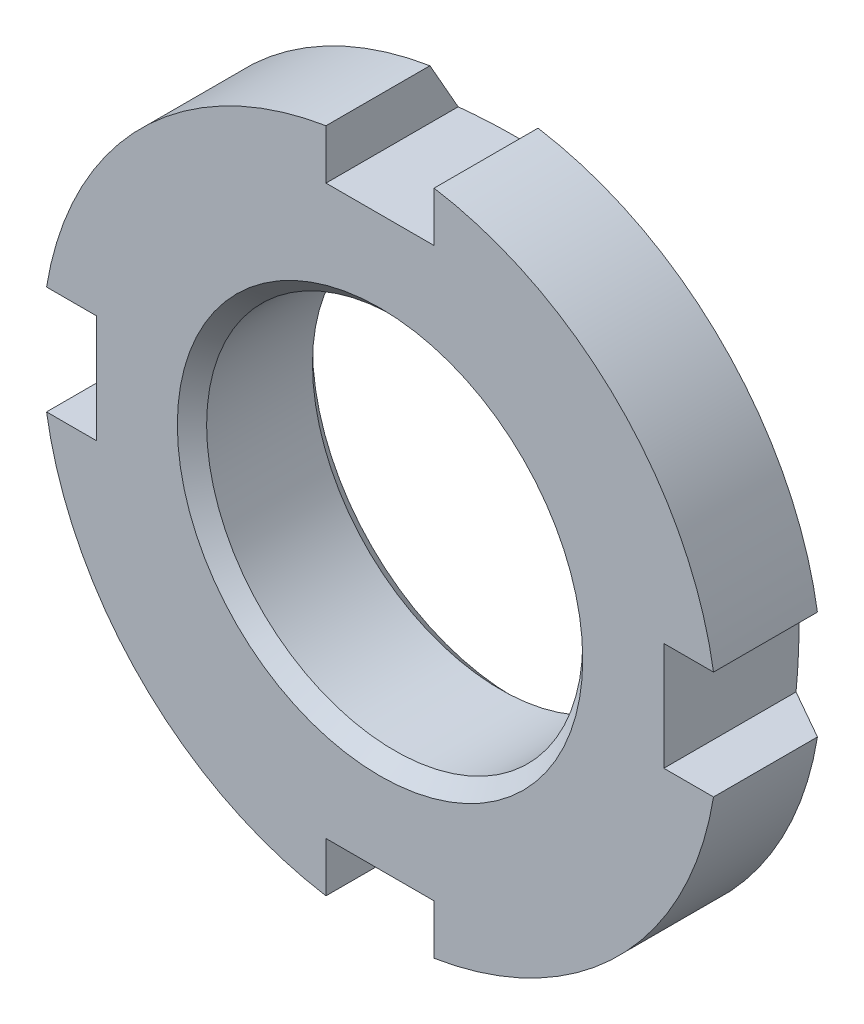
ISO-10303-21;
HEADER;
FILE_DESCRIPTION(('STEP AP214'),'2;1');
FILE_NAME('part.step','',(''),(''),'','','');
FILE_SCHEMA(('AUTOMOTIVE_DESIGN { 1 0 10303 214 1 1 1 1 }'));
ENDSEC;
DATA;
#1=APPLICATION_CONTEXT('core data for automotive mechanical design processes');
#2=APPLICATION_PROTOCOL_DEFINITION('international standard','automotive_design',2000,#1);
#3=PRODUCT_CONTEXT('',#1,'mechanical');
#4=PRODUCT('Part','Part','',(#3));
#5=PRODUCT_RELATED_PRODUCT_CATEGORY('part','',(#4));
#6=PRODUCT_DEFINITION_FORMATION('','',#4);
#7=PRODUCT_DEFINITION_CONTEXT('part definition',#1,'design');
#8=PRODUCT_DEFINITION('design','',#6,#7);
#9=PRODUCT_DEFINITION_SHAPE('','',#8);
#10=(LENGTH_UNIT() NAMED_UNIT(*) SI_UNIT(.MILLI.,.METRE.));
#11=(NAMED_UNIT(*) PLANE_ANGLE_UNIT() SI_UNIT($,.RADIAN.));
#12=(NAMED_UNIT(*) SI_UNIT($,.STERADIAN.) SOLID_ANGLE_UNIT());
#13=UNCERTAINTY_MEASURE_WITH_UNIT(LENGTH_MEASURE(1.E-05),#10,'distance_accuracy_value','');
#14=(GEOMETRIC_REPRESENTATION_CONTEXT(3) GLOBAL_UNCERTAINTY_ASSIGNED_CONTEXT((#13)) GLOBAL_UNIT_ASSIGNED_CONTEXT((#10,
#11,#12)) REPRESENTATION_CONTEXT('',''));
#15=CARTESIAN_POINT('',(0.,0.,0.));
#16=DIRECTION('',(0.,0.,1.));
#17=DIRECTION('',(1.,0.,0.));
#18=AXIS2_PLACEMENT_3D('',#15,#16,#17);
#19=CARTESIAN_POINT('',(0.,0.,-5.));
#20=DIRECTION('',(0.,0.,1.));
#21=DIRECTION('',(1.,0.,0.));
#22=AXIS2_PLACEMENT_3D('',#19,#20,#21);
#23=CYLINDRICAL_SURFACE('',#22,12.5);
#24=DIRECTION('',(0.,0.,1.));
#25=VECTOR('',#24,1.);
#26=CARTESIAN_POINT('',(-2.,12.3389626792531,-5.));
#27=LINE('',#26,#25);
#28=CARTESIAN_POINT('',(-2.,12.3389626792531,-3.8452994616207));
#29=VERTEX_POINT('',#28);
#30=CARTESIAN_POINT('',(-2.,12.3389626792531,0.));
#31=VERTEX_POINT('',#30);
#32=EDGE_CURVE('E240',#29,#31,#27,.T.);
#33=ORIENTED_EDGE('',*,*,#32,.F.);
#34=CARTESIAN_POINT('',(0.,0.,-3.8452994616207));
#35=DIRECTION('',(0.,0.,1.));
#36=DIRECTION('',(1.,0.,0.));
#37=AXIS2_PLACEMENT_3D('',#34,#35,#36);
#38=CIRCLE('',#37,12.5);
#39=CARTESIAN_POINT('',(-12.3389626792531,2.,-3.8452994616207));
#40=VERTEX_POINT('',#39);
#41=EDGE_CURVE('E247',#29,#40,#38,.T.);
#42=ORIENTED_EDGE('',*,*,#41,.T.);
#43=DIRECTION('',(0.,0.,1.));
#44=VECTOR('',#43,1.);
#45=CARTESIAN_POINT('',(-12.3389626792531,2.,-5.));
#46=LINE('',#45,#44);
#47=CARTESIAN_POINT('',(-12.3389626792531,2.,0.));
#48=VERTEX_POINT('',#47);
#49=EDGE_CURVE('E217',#48,#40,#46,.F.);
#50=ORIENTED_EDGE('',*,*,#49,.F.);
#51=CARTESIAN_POINT('',(0.,0.,0.));
#52=DIRECTION('',(0.,0.,1.));
#53=DIRECTION('',(1.,0.,0.));
#54=AXIS2_PLACEMENT_3D('',#51,#52,#53);
#55=CIRCLE('',#54,12.5);
#56=EDGE_CURVE('E186',#31,#48,#55,.T.);
#57=ORIENTED_EDGE('',*,*,#56,.F.);
#58=EDGE_LOOP('',(#33,#42,#50,#57));
#59=FACE_BOUND('',#58,.T.);
#60=ADVANCED_FACE('F33',(#59),#23,.T.);
#61=DIRECTION('',(0.,0.,1.));
#62=VECTOR('',#61,1.);
#63=CARTESIAN_POINT('',(2.,12.3389626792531,-5.));
#64=LINE('',#63,#62);
#65=CARTESIAN_POINT('',(2.,12.3389626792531,0.));
#66=VERTEX_POINT('',#65);
#67=CARTESIAN_POINT('',(2.,12.3389626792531,-3.8452994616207));
#68=VERTEX_POINT('',#67);
#69=EDGE_CURVE('E238',#66,#68,#64,.F.);
#70=ORIENTED_EDGE('',*,*,#69,.F.);
#71=CARTESIAN_POINT('',(12.3389626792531,2.,0.));
#72=VERTEX_POINT('',#71);
#73=EDGE_CURVE('E265',#72,#66,#55,.T.);
#74=ORIENTED_EDGE('',*,*,#73,.F.);
#75=DIRECTION('',(0.,0.,1.));
#76=VECTOR('',#75,1.);
#77=CARTESIAN_POINT('',(12.3389626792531,2.,-5.));
#78=LINE('',#77,#76);
#79=CARTESIAN_POINT('',(12.3389626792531,2.,-3.8452994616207));
#80=VERTEX_POINT('',#79);
#81=EDGE_CURVE('E236',#80,#72,#78,.T.);
#82=ORIENTED_EDGE('',*,*,#81,.F.);
#83=EDGE_CURVE('E243',#80,#68,#38,.T.);
#84=ORIENTED_EDGE('',*,*,#83,.T.);
#85=EDGE_LOOP('',(#70,#74,#82,#84));
#86=FACE_BOUND('',#85,.T.);
#87=ADVANCED_FACE('F440',(#86),#23,.T.);
#88=DIRECTION('',(0.,0.,1.));
#89=VECTOR('',#88,1.);
#90=CARTESIAN_POINT('',(12.3389626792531,-2.,-5.));
#91=LINE('',#90,#89);
#92=CARTESIAN_POINT('',(12.3389626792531,-2.,0.));
#93=VERTEX_POINT('',#92);
#94=CARTESIAN_POINT('',(12.3389626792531,-2.,-3.8452994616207));
#95=VERTEX_POINT('',#94);
#96=EDGE_CURVE('E52',#93,#95,#91,.F.);
#97=ORIENTED_EDGE('',*,*,#96,.F.);
#98=CARTESIAN_POINT('',(2.,-12.3389626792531,0.));
#99=VERTEX_POINT('',#98);
#100=EDGE_CURVE('E264',#99,#93,#55,.T.);
#101=ORIENTED_EDGE('',*,*,#100,.F.);
#102=DIRECTION('',(0.,0.,1.));
#103=VECTOR('',#102,1.);
#104=CARTESIAN_POINT('',(2.,-12.3389626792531,-5.));
#105=LINE('',#104,#103);
#106=CARTESIAN_POINT('',(2.,-12.3389626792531,-3.8452994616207));
#107=VERTEX_POINT('',#106);
#108=EDGE_CURVE('E233',#107,#99,#105,.T.);
#109=ORIENTED_EDGE('',*,*,#108,.F.);
#110=EDGE_CURVE('E242',#107,#95,#38,.T.);
#111=ORIENTED_EDGE('',*,*,#110,.T.);
#112=EDGE_LOOP('',(#97,#101,#109,#111));
#113=FACE_BOUND('',#112,.T.);
#114=ADVANCED_FACE('F412',(#113),#23,.T.);
#115=DIRECTION('',(0.,0.,1.));
#116=VECTOR('',#115,1.);
#117=CARTESIAN_POINT('',(-2.,-12.3389626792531,-5.));
#118=LINE('',#117,#116);
#119=CARTESIAN_POINT('',(-2.,-12.3389626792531,0.));
#120=VERTEX_POINT('',#119);
#121=CARTESIAN_POINT('',(-2.,-12.3389626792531,-3.8452994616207));
#122=VERTEX_POINT('',#121);
#123=EDGE_CURVE('E60',#120,#122,#118,.F.);
#124=ORIENTED_EDGE('',*,*,#123,.F.);
#125=CARTESIAN_POINT('',(-12.3389626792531,-2.,0.));
#126=VERTEX_POINT('',#125);
#127=EDGE_CURVE('E430',#126,#120,#55,.T.);
#128=ORIENTED_EDGE('',*,*,#127,.F.);
#129=DIRECTION('',(0.,0.,1.));
#130=VECTOR('',#129,1.);
#131=CARTESIAN_POINT('',(-12.3389626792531,-2.,-5.));
#132=LINE('',#131,#130);
#133=CARTESIAN_POINT('',(-12.3389626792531,-2.,-3.8452994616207));
#134=VERTEX_POINT('',#133);
#135=EDGE_CURVE('E230',#134,#126,#132,.T.);
#136=ORIENTED_EDGE('',*,*,#135,.F.);
#137=EDGE_CURVE('E414',#134,#122,#38,.T.);
#138=ORIENTED_EDGE('',*,*,#137,.T.);
#139=EDGE_LOOP('',(#124,#128,#136,#138));
#140=FACE_BOUND('',#139,.T.);
#141=ADVANCED_FACE('F431',(#140),#23,.T.);
#142=CARTESIAN_POINT('',(0.,12.5,0.));
#143=DIRECTION('',(0.,0.,-1.));
#144=DIRECTION('',(-1.,0.,0.));
#145=AXIS2_PLACEMENT_3D('',#142,#143,#144);
#146=PLANE('',#145);
#147=CARTESIAN_POINT('',(0.,0.,0.));
#148=DIRECTION('',(0.,0.,1.));
#149=DIRECTION('',(1.,0.,0.));
#150=AXIS2_PLACEMENT_3D('',#147,#148,#149);
#151=CIRCLE('',#150,7.5);
#152=CARTESIAN_POINT('',(7.5,0.,0.));
#153=VERTEX_POINT('',#152);
#154=EDGE_CURVE('E261',#153,#153,#151,.T.);
#155=ORIENTED_EDGE('',*,*,#154,.F.);
#156=EDGE_LOOP('',(#155));
#157=FACE_BOUND('',#156,.T.);
#158=DIRECTION('',(0.,1.,0.));
#159=VECTOR('',#158,1.);
#160=CARTESIAN_POINT('',(-2.,10.5,0.));
#161=LINE('',#160,#159);
#162=CARTESIAN_POINT('',(-2.,10.5,0.));
#163=VERTEX_POINT('',#162);
#164=EDGE_CURVE('E171',#163,#31,#161,.T.);
#165=ORIENTED_EDGE('',*,*,#164,.T.);
#166=ORIENTED_EDGE('',*,*,#56,.T.);
#167=DIRECTION('',(1.,0.,0.));
#168=VECTOR('',#167,1.);
#169=CARTESIAN_POINT('',(-19.126486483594,2.,0.));
#170=LINE('',#169,#168);
#171=CARTESIAN_POINT('',(-10.5,2.,0.));
#172=VERTEX_POINT('',#171);
#173=EDGE_CURVE('E164',#48,#172,#170,.T.);
#174=ORIENTED_EDGE('',*,*,#173,.T.);
#175=DIRECTION('',(0.,-1.,0.));
#176=VECTOR('',#175,1.);
#177=CARTESIAN_POINT('',(-10.5,2.,0.));
#178=LINE('',#177,#176);
#179=CARTESIAN_POINT('',(-10.5,-2.,0.));
#180=VERTEX_POINT('',#179);
#181=EDGE_CURVE('E174',#172,#180,#178,.T.);
#182=ORIENTED_EDGE('',*,*,#181,.T.);
#183=DIRECTION('',(-1.,0.,0.));
#184=VECTOR('',#183,1.);
#185=CARTESIAN_POINT('',(-10.5,-2.,0.));
#186=LINE('',#185,#184);
#187=EDGE_CURVE('E180',#180,#126,#186,.T.);
#188=ORIENTED_EDGE('',*,*,#187,.T.);
#189=ORIENTED_EDGE('',*,*,#127,.T.);
#190=DIRECTION('',(0.,1.,0.));
#191=VECTOR('',#190,1.);
#192=CARTESIAN_POINT('',(-2.,-19.126486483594,0.));
#193=LINE('',#192,#191);
#194=CARTESIAN_POINT('',(-2.,-10.5,0.));
#195=VERTEX_POINT('',#194);
#196=EDGE_CURVE('E190',#120,#195,#193,.T.);
#197=ORIENTED_EDGE('',*,*,#196,.T.);
#198=DIRECTION('',(1.,0.,0.));
#199=VECTOR('',#198,1.);
#200=CARTESIAN_POINT('',(-2.,-10.5,0.));
#201=LINE('',#200,#199);
#202=CARTESIAN_POINT('',(2.,-10.5,0.));
#203=VERTEX_POINT('',#202);
#204=EDGE_CURVE('E193',#195,#203,#201,.T.);
#205=ORIENTED_EDGE('',*,*,#204,.T.);
#206=DIRECTION('',(0.,-1.,0.));
#207=VECTOR('',#206,1.);
#208=CARTESIAN_POINT('',(2.,-10.5,0.));
#209=LINE('',#208,#207);
#210=EDGE_CURVE('E196',#203,#99,#209,.T.);
#211=ORIENTED_EDGE('',*,*,#210,.T.);
#212=ORIENTED_EDGE('',*,*,#100,.T.);
#213=DIRECTION('',(-1.,0.,0.));
#214=VECTOR('',#213,1.);
#215=CARTESIAN_POINT('',(19.126486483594,-2.,0.));
#216=LINE('',#215,#214);
#217=CARTESIAN_POINT('',(10.5,-2.,0.));
#218=VERTEX_POINT('',#217);
#219=EDGE_CURVE('E199',#93,#218,#216,.T.);
#220=ORIENTED_EDGE('',*,*,#219,.T.);
#221=DIRECTION('',(0.,1.,0.));
#222=VECTOR('',#221,1.);
#223=CARTESIAN_POINT('',(10.5,-2.,0.));
#224=LINE('',#223,#222);
#225=CARTESIAN_POINT('',(10.5,2.,0.));
#226=VERTEX_POINT('',#225);
#227=EDGE_CURVE('E202',#218,#226,#224,.T.);
#228=ORIENTED_EDGE('',*,*,#227,.T.);
#229=DIRECTION('',(1.,0.,0.));
#230=VECTOR('',#229,1.);
#231=CARTESIAN_POINT('',(10.5,2.,0.));
#232=LINE('',#231,#230);
#233=EDGE_CURVE('E205',#226,#72,#232,.T.);
#234=ORIENTED_EDGE('',*,*,#233,.T.);
#235=ORIENTED_EDGE('',*,*,#73,.T.);
#236=DIRECTION('',(0.,-1.,0.));
#237=VECTOR('',#236,1.);
#238=CARTESIAN_POINT('',(2.,19.126486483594,0.));
#239=LINE('',#238,#237);
#240=CARTESIAN_POINT('',(2.,10.5,0.));
#241=VERTEX_POINT('',#240);
#242=EDGE_CURVE('E208',#66,#241,#239,.T.);
#243=ORIENTED_EDGE('',*,*,#242,.T.);
#244=DIRECTION('',(-1.,0.,0.));
#245=VECTOR('',#244,1.);
#246=CARTESIAN_POINT('',(2.,10.5,0.));
#247=LINE('',#246,#245);
#248=EDGE_CURVE('E211',#241,#163,#247,.T.);
#249=ORIENTED_EDGE('',*,*,#248,.T.);
#250=EDGE_LOOP('',(#165,#166,#174,#182,#188,#189,#197,#205,#211,#212,#220,#228,#234,#235,#243,#249));
#251=FACE_BOUND('',#250,.T.);
#252=ADVANCED_FACE('F184',(#157,#251),#146,.F.);
#253=CARTESIAN_POINT('',(0.,0.,-5.));
#254=DIRECTION('',(0.,0.,1.));
#255=DIRECTION('',(1.,0.,0.));
#256=AXIS2_PLACEMENT_3D('',#253,#254,#255);
#257=CONICAL_SURFACE('',#256,10.5,1.04719755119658);
#258=CARTESIAN_POINT('',(-2.,6.81491479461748,-6.96164681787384));
#259=CARTESIAN_POINT('',(-2.,7.14533990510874,-6.77854960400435));
#260=CARTESIAN_POINT('',(-2.,7.47535686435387,-6.59471912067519));
#261=CARTESIAN_POINT('',(-2.,8.13476714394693,-6.22594601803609));
#262=CARTESIAN_POINT('',(-2.,8.46416046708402,-6.04100340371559));
#263=CARTESIAN_POINT('',(-2.,9.12251597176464,-5.67036055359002));
#264=CARTESIAN_POINT('',(-2.,9.451478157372,-5.48466032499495));
#265=CARTESIAN_POINT('',(-2.,10.1090812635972,-5.11269102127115));
#266=CARTESIAN_POINT('',(-2.,10.4377221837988,-4.92642194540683));
#267=CARTESIAN_POINT('',(-2.,11.4232794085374,-4.36698580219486));
#268=CARTESIAN_POINT('',(-2.,12.0798365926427,-3.99318619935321));
#269=CARTESIAN_POINT('',(-2.,13.0642370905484,-3.43171725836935));
#270=CARTESIAN_POINT('',(-2.,13.3922996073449,-3.24443179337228));
#271=CARTESIAN_POINT('',(-2.,14.0483033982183,-2.86964910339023));
#272=CARTESIAN_POINT('',(-2.,14.3762446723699,-2.68215187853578));
#273=CARTESIAN_POINT('',(-2.,14.7041379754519,-2.49457073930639));
#274=B_SPLINE_CURVE_WITH_KNOTS('',3,(#258,#259,#260,#261,#262,#263,#264,#265,#266,#267,#268,
#269,#270,#271,#272,#273),.UNSPECIFIED.,.F.,.F.,(4,2,2,2,2,2,2,4),(0.,1.13328761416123,
2.26657014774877,3.39984192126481,4.53311516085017,6.79963954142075,7.9329125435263,
9.06618484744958),.UNSPECIFIED.);
#275=CARTESIAN_POINT('',(-2.,10.5,-4.89100829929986));
#276=VERTEX_POINT('',#275);
#277=EDGE_CURVE('E11',#276,#29,#274,.T.);
#278=ORIENTED_EDGE('',*,*,#277,.F.);
#279=CARTESIAN_POINT('',(4.1991155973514,10.5,-4.53320210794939));
#280=CARTESIAN_POINT('',(3.9614767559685,10.5,-4.58415754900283));
#281=CARTESIAN_POINT('',(3.72304858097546,10.5,-4.63153580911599));
#282=CARTESIAN_POINT('',(3.24472592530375,10.5,-4.7184981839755));
#283=CARTESIAN_POINT('',(3.00483114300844,10.5,-4.75808063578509));
#284=CARTESIAN_POINT('',(2.52359039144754,10.5,-4.82881854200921));
#285=CARTESIAN_POINT('',(2.28224338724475,10.5,-4.85996700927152));
#286=CARTESIAN_POINT('',(1.79856661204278,10.5,-4.91323471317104));
#287=CARTESIAN_POINT('',(1.5562369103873,10.5,-4.93535457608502));
#288=CARTESIAN_POINT('',(1.07590400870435,10.5,-4.96977932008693));
#289=CARTESIAN_POINT('',(0.837914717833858,10.5,-4.9822773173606));
#290=CARTESIAN_POINT('',(0.361610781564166,10.5,-4.99795957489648));
#291=CARTESIAN_POINT('',(0.123296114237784,10.5,-5.00114317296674));
#292=CARTESIAN_POINT('',(-0.353101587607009,10.5,-4.99813089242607));
#293=CARTESIAN_POINT('',(-0.591184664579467,10.5,-4.991941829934));
#294=CARTESIAN_POINT('',(-1.06691202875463,10.5,-4.97032402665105));
#295=CARTESIAN_POINT('',(-1.30455633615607,10.5,-4.95489572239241));
#296=CARTESIAN_POINT('',(-1.87409286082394,10.5,-4.90711871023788));
#297=CARTESIAN_POINT('',(-2.20563147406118,10.5,-4.87046895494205));
#298=CARTESIAN_POINT('',(-2.86648973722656,10.5,-4.78089703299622));
#299=CARTESIAN_POINT('',(-3.19580913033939,10.5,-4.72797301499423));
#300=CARTESIAN_POINT('',(-4.18096825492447,10.5,-4.54700432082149));
#301=CARTESIAN_POINT('',(-4.83281644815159,10.5,-4.39687361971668));
#302=CARTESIAN_POINT('',(-5.81128127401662,10.5,-4.13556928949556));
#303=CARTESIAN_POINT('',(-6.14251026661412,10.5,-4.04074436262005));
#304=CARTESIAN_POINT('',(-6.80195597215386,10.5,-3.84096165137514));
#305=CARTESIAN_POINT('',(-7.13017241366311,10.5,-3.73600296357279));
#306=CARTESIAN_POINT('',(-7.78213207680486,10.5,-3.51805987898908));
#307=CARTESIAN_POINT('',(-8.10588927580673,10.5,-3.40511689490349));
#308=CARTESIAN_POINT('',(-8.75069727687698,10.5,-3.17205777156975));
#309=CARTESIAN_POINT('',(-9.07174892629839,10.5,-3.05194398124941));
#310=CARTESIAN_POINT('',(-9.39162981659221,10.5,-2.92885725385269));
#311=B_SPLINE_CURVE_WITH_KNOTS('',3,(#279,#280,#281,#282,#283,#284,#285,#286,#287,#288,#289,
#290,#291,#292,#293,#294,#295,#296,#297,#298,#299,#300,#301,#302,#303,#304,#305,#306,#307,#308,
#309,#310),.UNSPECIFIED.,.F.,.F.,(4,2,2,2,2,2,2,2,2,2,2,2,2,2,2,4),(0.,0.729126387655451,
1.45840813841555,2.18829222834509,2.91812568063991,3.632898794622,4.34772272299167,
5.06202705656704,5.7762976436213,6.7764974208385,7.77681102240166,9.78101719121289,
10.8145301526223,11.8481353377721,12.8767253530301,13.9049802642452),.UNSPECIFIED.);
#312=CARTESIAN_POINT('',(0.,10.5,-5.));
#313=VERTEX_POINT('',#312);
#314=EDGE_CURVE('E45',#313,#276,#311,.T.);
#315=ORIENTED_EDGE('',*,*,#314,.F.);
#316=CARTESIAN_POINT('',(0.,0.,-5.));
#317=DIRECTION('',(0.,0.,1.));
#318=DIRECTION('',(1.,0.,0.));
#319=AXIS2_PLACEMENT_3D('',#316,#317,#318);
#320=CIRCLE('',#319,10.5);
#321=CARTESIAN_POINT('',(-10.5,0.,-5.));
#322=VERTEX_POINT('',#321);
#323=EDGE_CURVE('E252',#313,#322,#320,.T.);
#324=ORIENTED_EDGE('',*,*,#323,.T.);
#325=CARTESIAN_POINT('',(-10.5,4.1991155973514,-4.53320210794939));
#326=CARTESIAN_POINT('',(-10.5,3.9614767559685,-4.58415754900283));
#327=CARTESIAN_POINT('',(-10.5,3.72304858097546,-4.63153580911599));
#328=CARTESIAN_POINT('',(-10.5,3.24472592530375,-4.7184981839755));
#329=CARTESIAN_POINT('',(-10.5,3.00483114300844,-4.75808063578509));
#330=CARTESIAN_POINT('',(-10.5,2.52359039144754,-4.82881854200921));
#331=CARTESIAN_POINT('',(-10.5,2.28224338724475,-4.85996700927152));
#332=CARTESIAN_POINT('',(-10.5,1.79856661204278,-4.91323471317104));
#333=CARTESIAN_POINT('',(-10.5,1.5562369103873,-4.93535457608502));
#334=CARTESIAN_POINT('',(-10.5,1.07590400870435,-4.96977932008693));
#335=CARTESIAN_POINT('',(-10.5,0.837914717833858,-4.9822773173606));
#336=CARTESIAN_POINT('',(-10.5,0.361610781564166,-4.99795957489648));
#337=CARTESIAN_POINT('',(-10.5,0.123296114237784,-5.00114317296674));
#338=CARTESIAN_POINT('',(-10.5,-0.353101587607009,-4.99813089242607));
#339=CARTESIAN_POINT('',(-10.5,-0.591184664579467,-4.991941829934));
#340=CARTESIAN_POINT('',(-10.5,-1.06691202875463,-4.97032402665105));
#341=CARTESIAN_POINT('',(-10.5,-1.30455633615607,-4.95489572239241));
#342=CARTESIAN_POINT('',(-10.5,-1.87409286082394,-4.90711871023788));
#343=CARTESIAN_POINT('',(-10.5,-2.20563147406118,-4.87046895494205));
#344=CARTESIAN_POINT('',(-10.5,-2.86648973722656,-4.78089703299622));
#345=CARTESIAN_POINT('',(-10.5,-3.19580913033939,-4.72797301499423));
#346=CARTESIAN_POINT('',(-10.5,-4.18096825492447,-4.54700432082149));
#347=CARTESIAN_POINT('',(-10.5,-4.83281644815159,-4.39687361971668));
#348=CARTESIAN_POINT('',(-10.5,-5.81128127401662,-4.13556928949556));
#349=CARTESIAN_POINT('',(-10.5,-6.14251026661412,-4.04074436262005));
#350=CARTESIAN_POINT('',(-10.5,-6.80195597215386,-3.84096165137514));
#351=CARTESIAN_POINT('',(-10.5,-7.13017241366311,-3.73600296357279));
#352=CARTESIAN_POINT('',(-10.5,-7.78213207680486,-3.51805987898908));
#353=CARTESIAN_POINT('',(-10.5,-8.10588927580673,-3.40511689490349));
#354=CARTESIAN_POINT('',(-10.5,-8.75069727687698,-3.17205777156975));
#355=CARTESIAN_POINT('',(-10.5,-9.07174892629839,-3.05194398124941));
#356=CARTESIAN_POINT('',(-10.5,-9.39162981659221,-2.92885725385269));
#357=B_SPLINE_CURVE_WITH_KNOTS('',3,(#325,#326,#327,#328,#329,#330,#331,#332,#333,#334,#335,
#336,#337,#338,#339,#340,#341,#342,#343,#344,#345,#346,#347,#348,#349,#350,#351,#352,#353,#354,
#355,#356),.UNSPECIFIED.,.F.,.F.,(4,2,2,2,2,2,2,2,2,2,2,2,2,2,2,4),(0.,0.729126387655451,
1.45840813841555,2.18829222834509,2.91812568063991,3.632898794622,4.34772272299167,
5.06202705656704,5.7762976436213,6.7764974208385,7.77681102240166,9.78101719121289,
10.8145301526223,11.8481353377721,12.8767253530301,13.9049802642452),.UNSPECIFIED.);
#358=CARTESIAN_POINT('',(-10.5,2.,-4.89100829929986));
#359=VERTEX_POINT('',#358);
#360=EDGE_CURVE('E273',#359,#322,#357,.T.);
#361=ORIENTED_EDGE('',*,*,#360,.F.);
#362=CARTESIAN_POINT('',(-16.0832585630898,2.,-1.70498440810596));
#363=CARTESIAN_POINT('',(-15.4276978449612,2.,-2.08053553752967));
#364=CARTESIAN_POINT('',(-14.772020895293,2.,-2.45588504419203));
#365=CARTESIAN_POINT('',(-13.460218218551,2.,-3.20579236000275));
#366=CARTESIAN_POINT('',(-12.8040924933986,2.,-3.58035017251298));
#367=CARTESIAN_POINT('',(-11.8193995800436,2.,-4.14130493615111));
#368=CARTESIAN_POINT('',(-11.4910838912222,2.,-4.32814324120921));
#369=CARTESIAN_POINT('',(-10.8342327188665,2.,-4.7014327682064));
#370=CARTESIAN_POINT('',(-10.5056972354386,2.,-4.88788399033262));
#371=CARTESIAN_POINT('',(-9.84834195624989,2.,-5.26028819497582));
#372=CARTESIAN_POINT('',(-9.51952215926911,2.,-5.44624117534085));
#373=CARTESIAN_POINT('',(-8.86149219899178,2.,-5.81745628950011));
#374=CARTESIAN_POINT('',(-8.5322820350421,2.,-6.00271842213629));
#375=CARTESIAN_POINT('',(-8.20282350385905,2.,-6.18753891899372));
#376=B_SPLINE_CURVE_WITH_KNOTS('',3,(#362,#363,#364,#365,#366,#367,#368,#369,#370,#371,#372,
#373,#374,#375),.UNSPECIFIED.,.F.,.F.,(4,2,2,2,2,2,4),(0.,2.26653723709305,4.53306483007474,
5.66633320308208,6.79960102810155,7.93287373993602,9.06614835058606),.UNSPECIFIED.);
#377=EDGE_CURVE('E167',#40,#359,#376,.T.);
#378=ORIENTED_EDGE('',*,*,#377,.F.);
#379=ORIENTED_EDGE('',*,*,#41,.F.);
#380=EDGE_LOOP('',(#278,#315,#324,#361,#378,#379));
#381=FACE_BOUND('',#380,.T.);
#382=ADVANCED_FACE('F279',(#381),#257,.T.);
#383=CARTESIAN_POINT('',(2.,10.5,-4.89100829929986));
#384=VERTEX_POINT('',#383);
#385=EDGE_CURVE('E371',#384,#313,#311,.T.);
#386=ORIENTED_EDGE('',*,*,#385,.F.);
#387=CARTESIAN_POINT('',(2.,14.7041379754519,-2.49457073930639));
#388=CARTESIAN_POINT('',(2.,14.3762446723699,-2.68215187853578));
#389=CARTESIAN_POINT('',(2.,14.0483033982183,-2.86964910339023));
#390=CARTESIAN_POINT('',(2.,13.3922996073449,-3.24443179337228));
#391=CARTESIAN_POINT('',(2.,13.0642370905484,-3.43171725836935));
#392=CARTESIAN_POINT('',(2.,12.0798365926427,-3.99318619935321));
#393=CARTESIAN_POINT('',(2.,11.4232794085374,-4.36698580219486));
#394=CARTESIAN_POINT('',(2.,10.4377221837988,-4.92642194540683));
#395=CARTESIAN_POINT('',(2.,10.1090812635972,-5.11269102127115));
#396=CARTESIAN_POINT('',(2.,9.451478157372,-5.48466032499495));
#397=CARTESIAN_POINT('',(2.,9.12251597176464,-5.67036055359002));
#398=CARTESIAN_POINT('',(2.,8.46416046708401,-6.04100340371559));
#399=CARTESIAN_POINT('',(2.,8.13476714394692,-6.22594601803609));
#400=CARTESIAN_POINT('',(2.,7.47535686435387,-6.59471912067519));
#401=CARTESIAN_POINT('',(2.,7.14533990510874,-6.77854960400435));
#402=CARTESIAN_POINT('',(2.,6.81491479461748,-6.96164681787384));
#403=B_SPLINE_CURVE_WITH_KNOTS('',3,(#387,#388,#389,#390,#391,#392,#393,#394,#395,#396,#397,
#398,#399,#400,#401,#402),.UNSPECIFIED.,.F.,.F.,(4,2,2,2,2,2,2,4),(0.,1.13327230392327,
2.26654530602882,4.53306968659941,5.66634292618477,6.7996146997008,7.93289723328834,
9.06618484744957),.UNSPECIFIED.);
#404=EDGE_CURVE('E351',#68,#384,#403,.T.);
#405=ORIENTED_EDGE('',*,*,#404,.F.);
#406=ORIENTED_EDGE('',*,*,#83,.F.);
#407=CARTESIAN_POINT('',(6.81491479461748,2.,-6.96164681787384));
#408=CARTESIAN_POINT('',(7.14533990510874,2.,-6.77854960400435));
#409=CARTESIAN_POINT('',(7.47535686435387,2.,-6.59471912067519));
#410=CARTESIAN_POINT('',(8.13476714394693,2.,-6.22594601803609));
#411=CARTESIAN_POINT('',(8.46416046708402,2.,-6.04100340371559));
#412=CARTESIAN_POINT('',(9.12251597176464,2.,-5.67036055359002));
#413=CARTESIAN_POINT('',(9.451478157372,2.,-5.48466032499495));
#414=CARTESIAN_POINT('',(10.1090812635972,2.,-5.11269102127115));
#415=CARTESIAN_POINT('',(10.4377221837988,2.,-4.92642194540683));
#416=CARTESIAN_POINT('',(11.4232794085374,2.,-4.36698580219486));
#417=CARTESIAN_POINT('',(12.0798365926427,2.,-3.99318619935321));
#418=CARTESIAN_POINT('',(13.0642370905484,2.,-3.43171725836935));
#419=CARTESIAN_POINT('',(13.3922996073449,2.,-3.24443179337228));
#420=CARTESIAN_POINT('',(14.0483033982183,2.,-2.86964910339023));
#421=CARTESIAN_POINT('',(14.3762446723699,2.,-2.68215187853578));
#422=CARTESIAN_POINT('',(14.7041379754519,2.,-2.49457073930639));
#423=B_SPLINE_CURVE_WITH_KNOTS('',3,(#407,#408,#409,#410,#411,#412,#413,#414,#415,#416,#417,
#418,#419,#420,#421,#422),.UNSPECIFIED.,.F.,.F.,(4,2,2,2,2,2,2,4),(0.,1.13328761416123,
2.26657014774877,3.39984192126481,4.53311516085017,6.79963954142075,7.9329125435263,
9.06618484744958),.UNSPECIFIED.);
#424=CARTESIAN_POINT('',(10.5,2.,-4.89100829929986));
#425=VERTEX_POINT('',#424);
#426=EDGE_CURVE('E346',#425,#80,#423,.T.);
#427=ORIENTED_EDGE('',*,*,#426,.F.);
#428=CARTESIAN_POINT('',(10.5,-9.39162981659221,-2.92885725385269));
#429=CARTESIAN_POINT('',(10.5,-9.07174892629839,-3.0519439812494));
#430=CARTESIAN_POINT('',(10.5,-8.75069727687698,-3.17205777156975));
#431=CARTESIAN_POINT('',(10.5,-8.10588927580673,-3.40511689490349));
#432=CARTESIAN_POINT('',(10.5,-7.78213207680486,-3.51805987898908));
#433=CARTESIAN_POINT('',(10.5,-7.13017241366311,-3.73600296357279));
#434=CARTESIAN_POINT('',(10.5,-6.80195597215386,-3.84096165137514));
#435=CARTESIAN_POINT('',(10.5,-6.14251026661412,-4.04074436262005));
#436=CARTESIAN_POINT('',(10.5,-5.81128127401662,-4.13556928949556));
#437=CARTESIAN_POINT('',(10.5,-4.83281644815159,-4.39687361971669));
#438=CARTESIAN_POINT('',(10.5,-4.18096825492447,-4.54700432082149));
#439=CARTESIAN_POINT('',(10.5,-3.19580913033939,-4.72797301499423));
#440=CARTESIAN_POINT('',(10.5,-2.86648973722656,-4.78089703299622));
#441=CARTESIAN_POINT('',(10.5,-2.20563147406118,-4.87046895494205));
#442=CARTESIAN_POINT('',(10.5,-1.87409286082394,-4.90711871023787));
#443=CARTESIAN_POINT('',(10.5,-1.30455633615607,-4.95489572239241));
#444=CARTESIAN_POINT('',(10.5,-1.06691202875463,-4.97032402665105));
#445=CARTESIAN_POINT('',(10.5,-0.591184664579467,-4.991941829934));
#446=CARTESIAN_POINT('',(10.5,-0.35310158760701,-4.99813089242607));
#447=CARTESIAN_POINT('',(10.5,0.123296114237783,-5.00114317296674));
#448=CARTESIAN_POINT('',(10.5,0.361610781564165,-4.99795957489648));
#449=CARTESIAN_POINT('',(10.5,0.837914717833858,-4.9822773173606));
#450=CARTESIAN_POINT('',(10.5,1.07590400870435,-4.96977932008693));
#451=CARTESIAN_POINT('',(10.5,1.5562369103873,-4.93535457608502));
#452=CARTESIAN_POINT('',(10.5,1.79856661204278,-4.91323471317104));
#453=CARTESIAN_POINT('',(10.5,2.28224338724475,-4.85996700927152));
#454=CARTESIAN_POINT('',(10.5,2.52359039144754,-4.82881854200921));
#455=CARTESIAN_POINT('',(10.5,3.00483114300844,-4.75808063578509));
#456=CARTESIAN_POINT('',(10.5,3.24472592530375,-4.7184981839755));
#457=CARTESIAN_POINT('',(10.5,3.72304858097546,-4.63153580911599));
#458=CARTESIAN_POINT('',(10.5,3.9614767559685,-4.58415754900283));
#459=CARTESIAN_POINT('',(10.5,4.1991155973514,-4.53320210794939));
#460=B_SPLINE_CURVE_WITH_KNOTS('',3,(#428,#429,#430,#431,#432,#433,#434,#435,#436,#437,#438,
#439,#440,#441,#442,#443,#444,#445,#446,#447,#448,#449,#450,#451,#452,#453,#454,#455,#456,#457,
#458,#459),.UNSPECIFIED.,.F.,.F.,(4,2,2,2,2,2,2,2,2,2,2,2,2,2,2,4),(0.,1.02825491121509,
2.0568449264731,3.09045011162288,4.12396307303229,6.12816924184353,7.12848284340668,
8.12868262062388,8.84295320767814,9.55725754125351,10.2720814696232,10.9868545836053,
11.7166880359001,12.4465721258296,13.1758538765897,13.9049802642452),.UNSPECIFIED.);
#461=CARTESIAN_POINT('',(10.5,0.,-5.));
#462=VERTEX_POINT('',#461);
#463=EDGE_CURVE('E345',#462,#425,#460,.T.);
#464=ORIENTED_EDGE('',*,*,#463,.F.);
#465=EDGE_CURVE('E248',#462,#313,#320,.T.);
#466=ORIENTED_EDGE('',*,*,#465,.T.);
#467=EDGE_LOOP('',(#386,#405,#406,#427,#464,#466));
#468=FACE_BOUND('',#467,.T.);
#469=ADVANCED_FACE('F383',(#468),#257,.T.);
#470=CARTESIAN_POINT('',(10.5,-2.,-4.89100829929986));
#471=VERTEX_POINT('',#470);
#472=EDGE_CURVE('E340',#471,#462,#460,.T.);
#473=ORIENTED_EDGE('',*,*,#472,.F.);
#474=CARTESIAN_POINT('',(14.7041379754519,-2.,-2.49457073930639));
#475=CARTESIAN_POINT('',(14.3762446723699,-2.,-2.68215187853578));
#476=CARTESIAN_POINT('',(14.0483033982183,-2.,-2.86964910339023));
#477=CARTESIAN_POINT('',(13.3922996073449,-2.,-3.24443179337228));
#478=CARTESIAN_POINT('',(13.0642370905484,-2.,-3.43171725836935));
#479=CARTESIAN_POINT('',(12.0798365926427,-2.,-3.99318619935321));
#480=CARTESIAN_POINT('',(11.4232794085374,-2.,-4.36698580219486));
#481=CARTESIAN_POINT('',(10.4377221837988,-2.,-4.92642194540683));
#482=CARTESIAN_POINT('',(10.1090812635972,-2.,-5.11269102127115));
#483=CARTESIAN_POINT('',(9.451478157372,-2.,-5.48466032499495));
#484=CARTESIAN_POINT('',(9.12251597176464,-2.,-5.67036055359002));
#485=CARTESIAN_POINT('',(8.46416046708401,-2.,-6.04100340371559));
#486=CARTESIAN_POINT('',(8.13476714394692,-2.,-6.22594601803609));
#487=CARTESIAN_POINT('',(7.47535686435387,-2.,-6.59471912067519));
#488=CARTESIAN_POINT('',(7.14533990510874,-2.,-6.77854960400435));
#489=CARTESIAN_POINT('',(6.81491479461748,-2.,-6.96164681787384));
#490=B_SPLINE_CURVE_WITH_KNOTS('',3,(#474,#475,#476,#477,#478,#479,#480,#481,#482,#483,#484,
#485,#486,#487,#488,#489),.UNSPECIFIED.,.F.,.F.,(4,2,2,2,2,2,2,4),(0.,1.13327230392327,
2.26654530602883,4.53306968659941,5.66634292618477,6.7996146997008,7.93289723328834,
9.06618484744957),.UNSPECIFIED.);
#491=EDGE_CURVE('E335',#95,#471,#490,.T.);
#492=ORIENTED_EDGE('',*,*,#491,.F.);
#493=ORIENTED_EDGE('',*,*,#110,.F.);
#494=CARTESIAN_POINT('',(2.,-8.20282350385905,-6.18753891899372));
#495=CARTESIAN_POINT('',(2.,-8.5322820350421,-6.00271842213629));
#496=CARTESIAN_POINT('',(2.,-8.86149219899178,-5.81745628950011));
#497=CARTESIAN_POINT('',(2.,-9.51952215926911,-5.44624117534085));
#498=CARTESIAN_POINT('',(2.,-9.84834195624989,-5.26028819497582));
#499=CARTESIAN_POINT('',(2.,-10.5056972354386,-4.88788399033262));
#500=CARTESIAN_POINT('',(2.,-10.8342327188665,-4.7014327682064));
#501=CARTESIAN_POINT('',(2.,-11.4910838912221,-4.32814324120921));
#502=CARTESIAN_POINT('',(2.,-11.8193995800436,-4.14130493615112));
#503=CARTESIAN_POINT('',(2.,-12.8040924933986,-3.58035017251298));
#504=CARTESIAN_POINT('',(2.,-13.460218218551,-3.20579236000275));
#505=CARTESIAN_POINT('',(2.,-14.772020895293,-2.45588504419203));
#506=CARTESIAN_POINT('',(2.,-15.4276978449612,-2.08053553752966));
#507=CARTESIAN_POINT('',(2.,-16.0832585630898,-1.70498440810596));
#508=B_SPLINE_CURVE_WITH_KNOTS('',3,(#494,#495,#496,#497,#498,#499,#500,#501,#502,#503,#504,
#505,#506,#507),.UNSPECIFIED.,.F.,.F.,(4,2,2,2,2,2,4),(0.,1.13327461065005,2.26654732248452,
3.39981514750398,4.53308352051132,6.79961111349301,9.06614835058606),.UNSPECIFIED.);
#509=CARTESIAN_POINT('',(2.,-10.5,-4.89100829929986));
#510=VERTEX_POINT('',#509);
#511=EDGE_CURVE('E313',#510,#107,#508,.T.);
#512=ORIENTED_EDGE('',*,*,#511,.F.);
#513=CARTESIAN_POINT('',(-9.39162981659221,-10.5,-2.92885725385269));
#514=CARTESIAN_POINT('',(-9.07174892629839,-10.5,-3.0519439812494));
#515=CARTESIAN_POINT('',(-8.75069727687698,-10.5,-3.17205777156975));
#516=CARTESIAN_POINT('',(-8.10588927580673,-10.5,-3.40511689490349));
#517=CARTESIAN_POINT('',(-7.78213207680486,-10.5,-3.51805987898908));
#518=CARTESIAN_POINT('',(-7.13017241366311,-10.5,-3.73600296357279));
#519=CARTESIAN_POINT('',(-6.80195597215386,-10.5,-3.84096165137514));
#520=CARTESIAN_POINT('',(-6.14251026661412,-10.5,-4.04074436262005));
#521=CARTESIAN_POINT('',(-5.81128127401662,-10.5,-4.13556928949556));
#522=CARTESIAN_POINT('',(-4.83281644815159,-10.5,-4.39687361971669));
#523=CARTESIAN_POINT('',(-4.18096825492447,-10.5,-4.54700432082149));
#524=CARTESIAN_POINT('',(-3.19580913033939,-10.5,-4.72797301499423));
#525=CARTESIAN_POINT('',(-2.86648973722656,-10.5,-4.78089703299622));
#526=CARTESIAN_POINT('',(-2.20563147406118,-10.5,-4.87046895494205));
#527=CARTESIAN_POINT('',(-1.87409286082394,-10.5,-4.90711871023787));
#528=CARTESIAN_POINT('',(-1.30455633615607,-10.5,-4.95489572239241));
#529=CARTESIAN_POINT('',(-1.06691202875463,-10.5,-4.97032402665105));
#530=CARTESIAN_POINT('',(-0.591184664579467,-10.5,-4.991941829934));
#531=CARTESIAN_POINT('',(-0.35310158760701,-10.5,-4.99813089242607));
#532=CARTESIAN_POINT('',(0.123296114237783,-10.5,-5.00114317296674));
#533=CARTESIAN_POINT('',(0.361610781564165,-10.5,-4.99795957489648));
#534=CARTESIAN_POINT('',(0.837914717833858,-10.5,-4.9822773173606));
#535=CARTESIAN_POINT('',(1.07590400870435,-10.5,-4.96977932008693));
#536=CARTESIAN_POINT('',(1.5562369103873,-10.5,-4.93535457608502));
#537=CARTESIAN_POINT('',(1.79856661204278,-10.5,-4.91323471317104));
#538=CARTESIAN_POINT('',(2.28224338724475,-10.5,-4.85996700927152));
#539=CARTESIAN_POINT('',(2.52359039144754,-10.5,-4.82881854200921));
#540=CARTESIAN_POINT('',(3.00483114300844,-10.5,-4.75808063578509));
#541=CARTESIAN_POINT('',(3.24472592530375,-10.5,-4.7184981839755));
#542=CARTESIAN_POINT('',(3.72304858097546,-10.5,-4.63153580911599));
#543=CARTESIAN_POINT('',(3.9614767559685,-10.5,-4.58415754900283));
#544=CARTESIAN_POINT('',(4.1991155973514,-10.5,-4.53320210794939));
#545=B_SPLINE_CURVE_WITH_KNOTS('',3,(#513,#514,#515,#516,#517,#518,#519,#520,#521,#522,#523,
#524,#525,#526,#527,#528,#529,#530,#531,#532,#533,#534,#535,#536,#537,#538,#539,#540,#541,#542,
#543,#544),.UNSPECIFIED.,.F.,.F.,(4,2,2,2,2,2,2,2,2,2,2,2,2,2,2,4),(0.,1.02825491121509,
2.0568449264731,3.09045011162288,4.12396307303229,6.12816924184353,7.12848284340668,
8.12868262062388,8.84295320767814,9.55725754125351,10.2720814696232,10.9868545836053,
11.7166880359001,12.4465721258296,13.1758538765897,13.9049802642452),.UNSPECIFIED.);
#546=CARTESIAN_POINT('',(0.,-10.5,-5.));
#547=VERTEX_POINT('',#546);
#548=EDGE_CURVE('E312',#547,#510,#545,.T.);
#549=ORIENTED_EDGE('',*,*,#548,.F.);
#550=EDGE_CURVE('E246',#547,#462,#320,.T.);
#551=ORIENTED_EDGE('',*,*,#550,.T.);
#552=EDGE_LOOP('',(#473,#492,#493,#512,#549,#551));
#553=FACE_BOUND('',#552,.T.);
#554=ADVANCED_FACE('F403',(#553),#257,.T.);
#555=CARTESIAN_POINT('',(-2.,-10.5,-4.89100829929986));
#556=VERTEX_POINT('',#555);
#557=EDGE_CURVE('E307',#556,#547,#545,.T.);
#558=ORIENTED_EDGE('',*,*,#557,.F.);
#559=CARTESIAN_POINT('',(-2.,-16.0832585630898,-1.70498440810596));
#560=CARTESIAN_POINT('',(-2.,-15.4276978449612,-2.08053553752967));
#561=CARTESIAN_POINT('',(-2.,-14.772020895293,-2.45588504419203));
#562=CARTESIAN_POINT('',(-2.,-13.460218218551,-3.20579236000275));
#563=CARTESIAN_POINT('',(-2.,-12.8040924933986,-3.58035017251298));
#564=CARTESIAN_POINT('',(-2.,-11.8193995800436,-4.14130493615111));
#565=CARTESIAN_POINT('',(-2.,-11.4910838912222,-4.32814324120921));
#566=CARTESIAN_POINT('',(-2.,-10.8342327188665,-4.7014327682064));
#567=CARTESIAN_POINT('',(-2.,-10.5056972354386,-4.88788399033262));
#568=CARTESIAN_POINT('',(-2.,-9.84834195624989,-5.26028819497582));
#569=CARTESIAN_POINT('',(-2.,-9.51952215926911,-5.44624117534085));
#570=CARTESIAN_POINT('',(-2.,-8.86149219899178,-5.81745628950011));
#571=CARTESIAN_POINT('',(-2.,-8.5322820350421,-6.00271842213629));
#572=CARTESIAN_POINT('',(-2.,-8.20282350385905,-6.18753891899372));
#573=B_SPLINE_CURVE_WITH_KNOTS('',3,(#559,#560,#561,#562,#563,#564,#565,#566,#567,#568,#569,
#570,#571,#572),.UNSPECIFIED.,.F.,.F.,(4,2,2,2,2,2,4),(0.,2.26653723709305,4.53306483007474,
5.66633320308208,6.79960102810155,7.93287373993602,9.06614835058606),.UNSPECIFIED.);
#574=EDGE_CURVE('E301',#122,#556,#573,.T.);
#575=ORIENTED_EDGE('',*,*,#574,.F.);
#576=ORIENTED_EDGE('',*,*,#137,.F.);
#577=CARTESIAN_POINT('',(-8.20282350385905,-2.,-6.18753891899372));
#578=CARTESIAN_POINT('',(-8.5322820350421,-2.,-6.00271842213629));
#579=CARTESIAN_POINT('',(-8.86149219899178,-2.,-5.81745628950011));
#580=CARTESIAN_POINT('',(-9.51952215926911,-2.,-5.44624117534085));
#581=CARTESIAN_POINT('',(-9.84834195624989,-2.,-5.26028819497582));
#582=CARTESIAN_POINT('',(-10.5056972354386,-2.,-4.88788399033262));
#583=CARTESIAN_POINT('',(-10.8342327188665,-2.,-4.7014327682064));
#584=CARTESIAN_POINT('',(-11.4910838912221,-2.,-4.32814324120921));
#585=CARTESIAN_POINT('',(-11.8193995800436,-2.,-4.14130493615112));
#586=CARTESIAN_POINT('',(-12.8040924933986,-2.,-3.58035017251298));
#587=CARTESIAN_POINT('',(-13.460218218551,-2.,-3.20579236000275));
#588=CARTESIAN_POINT('',(-14.772020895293,-2.,-2.45588504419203));
#589=CARTESIAN_POINT('',(-15.4276978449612,-2.,-2.08053553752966));
#590=CARTESIAN_POINT('',(-16.0832585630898,-2.,-1.70498440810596));
#591=B_SPLINE_CURVE_WITH_KNOTS('',3,(#577,#578,#579,#580,#581,#582,#583,#584,#585,#586,#587,
#588,#589,#590),.UNSPECIFIED.,.F.,.F.,(4,2,2,2,2,2,4),(0.,1.13327461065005,2.26654732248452,
3.39981514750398,4.53308352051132,6.79961111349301,9.06614835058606),.UNSPECIFIED.);
#592=CARTESIAN_POINT('',(-10.5,-2.,-4.89100829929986));
#593=VERTEX_POINT('',#592);
#594=EDGE_CURVE('E296',#593,#134,#591,.T.);
#595=ORIENTED_EDGE('',*,*,#594,.F.);
#596=EDGE_CURVE('E302',#322,#593,#357,.T.);
#597=ORIENTED_EDGE('',*,*,#596,.F.);
#598=EDGE_CURVE('E395',#322,#547,#320,.T.);
#599=ORIENTED_EDGE('',*,*,#598,.T.);
#600=EDGE_LOOP('',(#558,#575,#576,#595,#597,#599));
#601=FACE_BOUND('',#600,.T.);
#602=ADVANCED_FACE('F425',(#601),#257,.T.);
#603=CARTESIAN_POINT('',(0.,0.,0.));
#604=DIRECTION('',(0.,0.,1.));
#605=DIRECTION('',(1.,0.,0.));
#606=AXIS2_PLACEMENT_3D('',#603,#604,#605);
#607=CONICAL_SURFACE('',#606,7.5,0.785398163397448);
#608=CARTESIAN_POINT('',(0.,0.,-0.5415));
#609=DIRECTION('',(0.,0.,1.));
#610=DIRECTION('',(1.,0.,0.));
#611=AXIS2_PLACEMENT_3D('',#608,#609,#610);
#612=CIRCLE('',#611,6.9585);
#613=CARTESIAN_POINT('',(6.9585,0.,-0.5415));
#614=VERTEX_POINT('',#613);
#615=EDGE_CURVE('E258',#614,#614,#612,.T.);
#616=ORIENTED_EDGE('',*,*,#615,.F.);
#617=EDGE_LOOP('',(#616));
#618=FACE_BOUND('',#617,.T.);
#619=ORIENTED_EDGE('',*,*,#154,.T.);
#620=EDGE_LOOP('',(#619));
#621=FACE_BOUND('',#620,.T.);
#622=ADVANCED_FACE('F458',(#618,#621),#607,.F.);
#623=CARTESIAN_POINT('',(0.,0.,-5.));
#624=DIRECTION('',(0.,0.,1.));
#625=DIRECTION('',(1.,0.,0.));
#626=AXIS2_PLACEMENT_3D('',#623,#624,#625);
#627=CYLINDRICAL_SURFACE('',#626,6.9585);
#628=CARTESIAN_POINT('',(0.,0.,-4.4585));
#629=DIRECTION('',(0.,0.,1.));
#630=DIRECTION('',(1.,0.,0.));
#631=AXIS2_PLACEMENT_3D('',#628,#629,#630);
#632=CIRCLE('',#631,6.9585);
#633=CARTESIAN_POINT('',(6.9585,0.,-4.4585));
#634=VERTEX_POINT('',#633);
#635=EDGE_CURVE('E255',#634,#634,#632,.T.);
#636=ORIENTED_EDGE('',*,*,#635,.F.);
#637=EDGE_LOOP('',(#636));
#638=FACE_BOUND('',#637,.T.);
#639=ORIENTED_EDGE('',*,*,#615,.T.);
#640=EDGE_LOOP('',(#639));
#641=FACE_BOUND('',#640,.T.);
#642=ADVANCED_FACE('F461',(#638,#641),#627,.F.);
#643=CARTESIAN_POINT('',(0.,0.,-4.4585));
#644=DIRECTION('',(0.,0.,-1.));
#645=DIRECTION('',(-1.,0.,0.));
#646=AXIS2_PLACEMENT_3D('',#643,#644,#645);
#647=CONICAL_SURFACE('',#646,6.9585,0.785398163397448);
#648=CARTESIAN_POINT('',(0.,0.,-5.));
#649=DIRECTION('',(0.,0.,1.));
#650=DIRECTION('',(1.,0.,0.));
#651=AXIS2_PLACEMENT_3D('',#648,#649,#650);
#652=CIRCLE('',#651,7.5);
#653=CARTESIAN_POINT('',(7.5,0.,-5.));
#654=VERTEX_POINT('',#653);
#655=EDGE_CURVE('E251',#654,#654,#652,.T.);
#656=ORIENTED_EDGE('',*,*,#655,.F.);
#657=EDGE_LOOP('',(#656));
#658=FACE_BOUND('',#657,.T.);
#659=ORIENTED_EDGE('',*,*,#635,.T.);
#660=EDGE_LOOP('',(#659));
#661=FACE_BOUND('',#660,.T.);
#662=ADVANCED_FACE('F465',(#658,#661),#647,.F.);
#663=CARTESIAN_POINT('',(0.,7.5,-5.));
#664=DIRECTION('',(0.,0.,1.));
#665=DIRECTION('',(1.,0.,0.));
#666=AXIS2_PLACEMENT_3D('',#663,#664,#665);
#667=PLANE('',#666);
#668=ORIENTED_EDGE('',*,*,#465,.F.);
#669=ORIENTED_EDGE('',*,*,#550,.F.);
#670=ORIENTED_EDGE('',*,*,#598,.F.);
#671=ORIENTED_EDGE('',*,*,#323,.F.);
#672=EDGE_LOOP('',(#668,#669,#670,#671));
#673=FACE_BOUND('',#672,.T.);
#674=ORIENTED_EDGE('',*,*,#655,.T.);
#675=EDGE_LOOP('',(#674));
#676=FACE_BOUND('',#675,.T.);
#677=ADVANCED_FACE('F284',(#673,#676),#667,.F.);
#678=CARTESIAN_POINT('',(-19.126486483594,2.,-5.));
#679=DIRECTION('',(0.,-1.,0.));
#680=DIRECTION('',(0.,0.,-1.));
#681=AXIS2_PLACEMENT_3D('',#678,#679,#680);
#682=PLANE('',#681);
#683=ORIENTED_EDGE('',*,*,#49,.T.);
#684=ORIENTED_EDGE('',*,*,#377,.T.);
#685=DIRECTION('',(0.,0.,1.));
#686=VECTOR('',#685,1.);
#687=CARTESIAN_POINT('',(-10.5,2.,-5.));
#688=LINE('',#687,#686);
#689=EDGE_CURVE('E160',#359,#172,#688,.T.);
#690=ORIENTED_EDGE('',*,*,#689,.T.);
#691=ORIENTED_EDGE('',*,*,#173,.F.);
#692=EDGE_LOOP('',(#683,#684,#690,#691));
#693=FACE_BOUND('',#692,.T.);
#694=ADVANCED_FACE('F162',(#693),#682,.T.);
#695=CARTESIAN_POINT('',(-10.5,2.,-5.));
#696=DIRECTION('',(-1.,0.,0.));
#697=DIRECTION('',(0.,0.,1.));
#698=AXIS2_PLACEMENT_3D('',#695,#696,#697);
#699=PLANE('',#698);
#700=ORIENTED_EDGE('',*,*,#360,.T.);
#701=ORIENTED_EDGE('',*,*,#596,.T.);
#702=DIRECTION('',(0.,0.,1.));
#703=VECTOR('',#702,1.);
#704=CARTESIAN_POINT('',(-10.5,-2.,-5.));
#705=LINE('',#704,#703);
#706=EDGE_CURVE('E170',#593,#180,#705,.T.);
#707=ORIENTED_EDGE('',*,*,#706,.T.);
#708=ORIENTED_EDGE('',*,*,#181,.F.);
#709=ORIENTED_EDGE('',*,*,#689,.F.);
#710=EDGE_LOOP('',(#700,#701,#707,#708,#709));
#711=FACE_BOUND('',#710,.T.);
#712=ADVANCED_FACE('F175',(#711),#699,.T.);
#713=CARTESIAN_POINT('',(-10.5,-2.,-5.));
#714=DIRECTION('',(0.,1.,0.));
#715=DIRECTION('',(0.,0.,1.));
#716=AXIS2_PLACEMENT_3D('',#713,#714,#715);
#717=PLANE('',#716);
#718=ORIENTED_EDGE('',*,*,#135,.T.);
#719=ORIENTED_EDGE('',*,*,#187,.F.);
#720=ORIENTED_EDGE('',*,*,#706,.F.);
#721=ORIENTED_EDGE('',*,*,#594,.T.);
#722=EDGE_LOOP('',(#718,#719,#720,#721));
#723=FACE_BOUND('',#722,.T.);
#724=ADVANCED_FACE('F288',(#723),#717,.T.);
#725=CARTESIAN_POINT('',(-2.,-19.126486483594,-5.));
#726=DIRECTION('',(1.,0.,0.));
#727=DIRECTION('',(0.,0.,-1.));
#728=AXIS2_PLACEMENT_3D('',#725,#726,#727);
#729=PLANE('',#728);
#730=ORIENTED_EDGE('',*,*,#123,.T.);
#731=ORIENTED_EDGE('',*,*,#574,.T.);
#732=DIRECTION('',(0.,0.,1.));
#733=VECTOR('',#732,1.);
#734=CARTESIAN_POINT('',(-2.,-10.5,-5.));
#735=LINE('',#734,#733);
#736=EDGE_CURVE('E226',#556,#195,#735,.T.);
#737=ORIENTED_EDGE('',*,*,#736,.T.);
#738=ORIENTED_EDGE('',*,*,#196,.F.);
#739=EDGE_LOOP('',(#730,#731,#737,#738));
#740=FACE_BOUND('',#739,.T.);
#741=ADVANCED_FACE('F292',(#740),#729,.T.);
#742=CARTESIAN_POINT('',(-2.,-10.5,-5.));
#743=DIRECTION('',(0.,-1.,0.));
#744=DIRECTION('',(0.,0.,-1.));
#745=AXIS2_PLACEMENT_3D('',#742,#743,#744);
#746=PLANE('',#745);
#747=ORIENTED_EDGE('',*,*,#557,.T.);
#748=ORIENTED_EDGE('',*,*,#548,.T.);
#749=DIRECTION('',(0.,0.,1.));
#750=VECTOR('',#749,1.);
#751=CARTESIAN_POINT('',(2.,-10.5,-5.));
#752=LINE('',#751,#750);
#753=EDGE_CURVE('E224',#510,#203,#752,.T.);
#754=ORIENTED_EDGE('',*,*,#753,.T.);
#755=ORIENTED_EDGE('',*,*,#204,.F.);
#756=ORIENTED_EDGE('',*,*,#736,.F.);
#757=EDGE_LOOP('',(#747,#748,#754,#755,#756));
#758=FACE_BOUND('',#757,.T.);
#759=ADVANCED_FACE('F319',(#758),#746,.T.);
#760=CARTESIAN_POINT('',(2.,-10.5,-5.));
#761=DIRECTION('',(-1.,0.,0.));
#762=DIRECTION('',(0.,0.,1.));
#763=AXIS2_PLACEMENT_3D('',#760,#761,#762);
#764=PLANE('',#763);
#765=ORIENTED_EDGE('',*,*,#108,.T.);
#766=ORIENTED_EDGE('',*,*,#210,.F.);
#767=ORIENTED_EDGE('',*,*,#753,.F.);
#768=ORIENTED_EDGE('',*,*,#511,.T.);
#769=EDGE_LOOP('',(#765,#766,#767,#768));
#770=FACE_BOUND('',#769,.T.);
#771=ADVANCED_FACE('F322',(#770),#764,.T.);
#772=CARTESIAN_POINT('',(19.126486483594,-2.,-5.));
#773=DIRECTION('',(0.,1.,0.));
#774=DIRECTION('',(0.,0.,1.));
#775=AXIS2_PLACEMENT_3D('',#772,#773,#774);
#776=PLANE('',#775);
#777=ORIENTED_EDGE('',*,*,#96,.T.);
#778=ORIENTED_EDGE('',*,*,#491,.T.);
#779=DIRECTION('',(0.,0.,1.));
#780=VECTOR('',#779,1.);
#781=CARTESIAN_POINT('',(10.5,-2.,-5.));
#782=LINE('',#781,#780);
#783=EDGE_CURVE('E222',#471,#218,#782,.T.);
#784=ORIENTED_EDGE('',*,*,#783,.T.);
#785=ORIENTED_EDGE('',*,*,#219,.F.);
#786=EDGE_LOOP('',(#777,#778,#784,#785));
#787=FACE_BOUND('',#786,.T.);
#788=ADVANCED_FACE('F327',(#787),#776,.T.);
#789=CARTESIAN_POINT('',(10.5,-2.,-5.));
#790=DIRECTION('',(1.,0.,0.));
#791=DIRECTION('',(0.,0.,-1.));
#792=AXIS2_PLACEMENT_3D('',#789,#790,#791);
#793=PLANE('',#792);
#794=ORIENTED_EDGE('',*,*,#472,.T.);
#795=ORIENTED_EDGE('',*,*,#463,.T.);
#796=DIRECTION('',(0.,0.,1.));
#797=VECTOR('',#796,1.);
#798=CARTESIAN_POINT('',(10.5,2.,-5.));
#799=LINE('',#798,#797);
#800=EDGE_CURVE('E220',#425,#226,#799,.T.);
#801=ORIENTED_EDGE('',*,*,#800,.T.);
#802=ORIENTED_EDGE('',*,*,#227,.F.);
#803=ORIENTED_EDGE('',*,*,#783,.F.);
#804=EDGE_LOOP('',(#794,#795,#801,#802,#803));
#805=FACE_BOUND('',#804,.T.);
#806=ADVANCED_FACE('F332',(#805),#793,.T.);
#807=CARTESIAN_POINT('',(10.5,2.,-5.));
#808=DIRECTION('',(0.,-1.,0.));
#809=DIRECTION('',(0.,0.,-1.));
#810=AXIS2_PLACEMENT_3D('',#807,#808,#809);
#811=PLANE('',#810);
#812=ORIENTED_EDGE('',*,*,#81,.T.);
#813=ORIENTED_EDGE('',*,*,#233,.F.);
#814=ORIENTED_EDGE('',*,*,#800,.F.);
#815=ORIENTED_EDGE('',*,*,#426,.T.);
#816=EDGE_LOOP('',(#812,#813,#814,#815));
#817=FACE_BOUND('',#816,.T.);
#818=ADVANCED_FACE('F356',(#817),#811,.T.);
#819=CARTESIAN_POINT('',(-2.,10.5,-5.));
#820=DIRECTION('',(1.,0.,0.));
#821=DIRECTION('',(0.,0.,-1.));
#822=AXIS2_PLACEMENT_3D('',#819,#820,#821);
#823=PLANE('',#822);
#824=ORIENTED_EDGE('',*,*,#32,.T.);
#825=ORIENTED_EDGE('',*,*,#164,.F.);
#826=DIRECTION('',(0.,0.,1.));
#827=VECTOR('',#826,1.);
#828=CARTESIAN_POINT('',(-2.,10.5,-5.));
#829=LINE('',#828,#827);
#830=EDGE_CURVE('E215',#276,#163,#829,.T.);
#831=ORIENTED_EDGE('',*,*,#830,.F.);
#832=ORIENTED_EDGE('',*,*,#277,.T.);
#833=EDGE_LOOP('',(#824,#825,#831,#832));
#834=FACE_BOUND('',#833,.T.);
#835=ADVANCED_FACE('F359',(#834),#823,.T.);
#836=CARTESIAN_POINT('',(2.,10.5,-5.));
#837=DIRECTION('',(0.,1.,0.));
#838=DIRECTION('',(0.,0.,1.));
#839=AXIS2_PLACEMENT_3D('',#836,#837,#838);
#840=PLANE('',#839);
#841=ORIENTED_EDGE('',*,*,#385,.T.);
#842=ORIENTED_EDGE('',*,*,#314,.T.);
#843=ORIENTED_EDGE('',*,*,#830,.T.);
#844=ORIENTED_EDGE('',*,*,#248,.F.);
#845=DIRECTION('',(0.,0.,1.));
#846=VECTOR('',#845,1.);
#847=CARTESIAN_POINT('',(2.,10.5,-5.));
#848=LINE('',#847,#846);
#849=EDGE_CURVE('E218',#384,#241,#848,.T.);
#850=ORIENTED_EDGE('',*,*,#849,.F.);
#851=EDGE_LOOP('',(#841,#842,#843,#844,#850));
#852=FACE_BOUND('',#851,.T.);
#853=ADVANCED_FACE('F365',(#852),#840,.T.);
#854=CARTESIAN_POINT('',(2.,19.126486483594,-5.));
#855=DIRECTION('',(-1.,0.,0.));
#856=DIRECTION('',(0.,0.,1.));
#857=AXIS2_PLACEMENT_3D('',#854,#855,#856);
#858=PLANE('',#857);
#859=ORIENTED_EDGE('',*,*,#69,.T.);
#860=ORIENTED_EDGE('',*,*,#404,.T.);
#861=ORIENTED_EDGE('',*,*,#849,.T.);
#862=ORIENTED_EDGE('',*,*,#242,.F.);
#863=EDGE_LOOP('',(#859,#860,#861,#862));
#864=FACE_BOUND('',#863,.T.);
#865=ADVANCED_FACE('F361',(#864),#858,.T.);
#866=CLOSED_SHELL('',(#60,#87,#114,#141,#252,#382,#469,#554,#602,#622,#642,#662,#677,#694,#712,
#724,#741,#759,#771,#788,#806,#818,#835,#853,#865));
#867=MANIFOLD_SOLID_BREP('B2',#866);
#868=ADVANCED_BREP_SHAPE_REPRESENTATION('',(#18,#867),#14);
#869=SHAPE_DEFINITION_REPRESENTATION(#9,#868);
ENDSEC;
END-ISO-10303-21;
